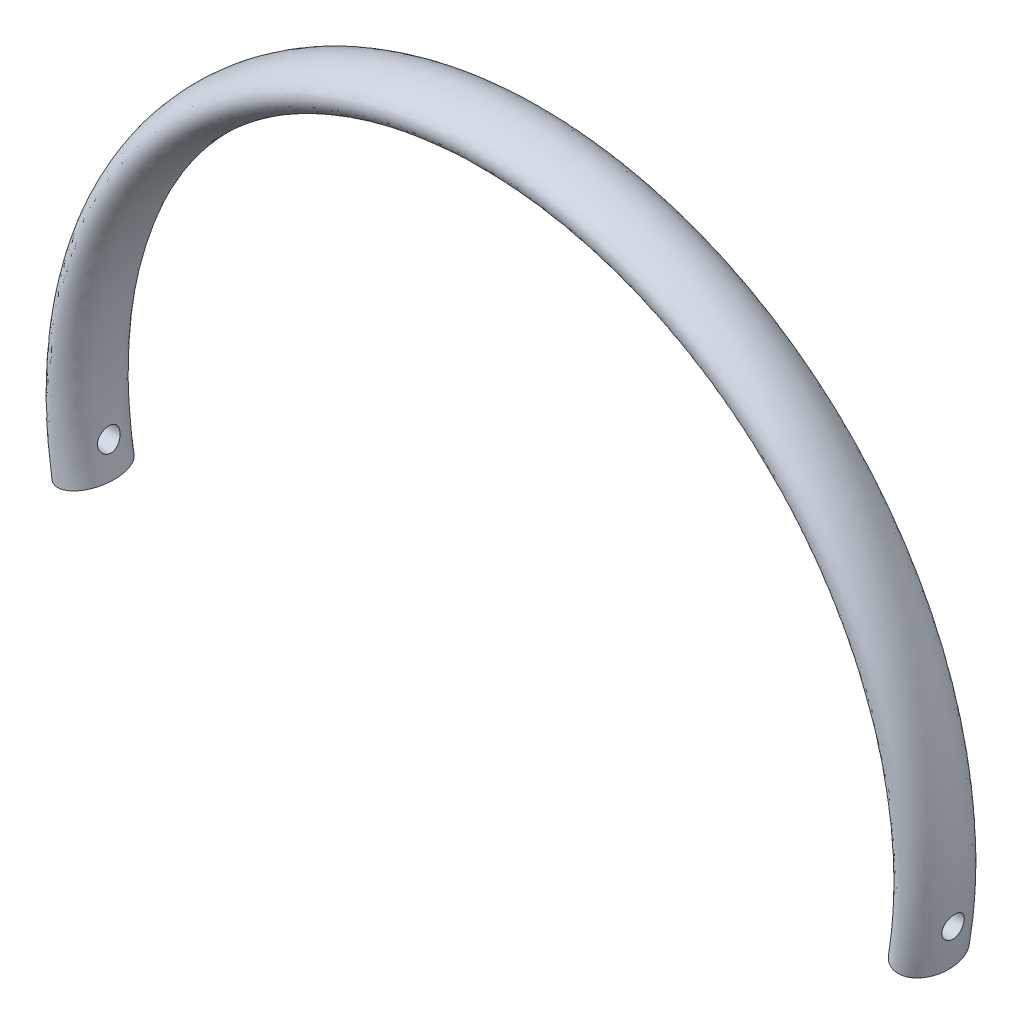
ISO-10303-21;
HEADER;
FILE_DESCRIPTION(('STEP AP214'),'2;1');
FILE_NAME('part.step','',(''),(''),'','','');
FILE_SCHEMA(('AUTOMOTIVE_DESIGN { 1 0 10303 214 1 1 1 1 }'));
ENDSEC;
DATA;
#1=APPLICATION_CONTEXT('core data for automotive mechanical design processes');
#2=APPLICATION_PROTOCOL_DEFINITION('international standard','automotive_design',2000,#1);
#3=PRODUCT_CONTEXT('',#1,'mechanical');
#4=PRODUCT('Part','Part','',(#3));
#5=PRODUCT_RELATED_PRODUCT_CATEGORY('part','',(#4));
#6=PRODUCT_DEFINITION_FORMATION('','',#4);
#7=PRODUCT_DEFINITION_CONTEXT('part definition',#1,'design');
#8=PRODUCT_DEFINITION('design','',#6,#7);
#9=PRODUCT_DEFINITION_SHAPE('','',#8);
#10=(LENGTH_UNIT() NAMED_UNIT(*) SI_UNIT(.MILLI.,.METRE.));
#11=(NAMED_UNIT(*) PLANE_ANGLE_UNIT() SI_UNIT($,.RADIAN.));
#12=(NAMED_UNIT(*) SI_UNIT($,.STERADIAN.) SOLID_ANGLE_UNIT());
#13=UNCERTAINTY_MEASURE_WITH_UNIT(LENGTH_MEASURE(1.E-05),#10,'distance_accuracy_value','');
#14=(GEOMETRIC_REPRESENTATION_CONTEXT(3) GLOBAL_UNCERTAINTY_ASSIGNED_CONTEXT((#13)) GLOBAL_UNIT_ASSIGNED_CONTEXT((#10,
#11,#12)) REPRESENTATION_CONTEXT('',''));
#15=CARTESIAN_POINT('',(0.,0.,0.));
#16=DIRECTION('',(0.,0.,1.));
#17=DIRECTION('',(1.,0.,0.));
#18=AXIS2_PLACEMENT_3D('',#15,#16,#17);
#19=CARTESIAN_POINT('',(751.342132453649,-1.0547118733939E-11,0.));
#20=DIRECTION('',(-0.328671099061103,-0.94444444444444,0.));
#21=DIRECTION('',(0.,0.,-1.));
#22=AXIS2_PLACEMENT_3D('',#19,#20,#21);
#23=ELLIPSE('',#22,63.5,38.1);
#24=CARTESIAN_POINT('',(0.,127.,0.));
#25=DIRECTION('',(0.,0.,1.));
#26=AXIS1_PLACEMENT('',#24,#25);
#27=SURFACE_OF_REVOLUTION('',#23,#26);
#28=CARTESIAN_POINT('',(-794.690720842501,58.441152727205,-20.1788155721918));
#29=CARTESIAN_POINT('',(-794.739829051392,59.0104256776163,-20.1788227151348));
#30=CARTESIAN_POINT('',(-794.793097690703,59.5792348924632,-20.1547170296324));
#31=CARTESIAN_POINT('',(-794.907450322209,60.7121908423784,-20.0586674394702));
#32=CARTESIAN_POINT('',(-794.968536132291,61.2763364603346,-19.9867123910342));
#33=CARTESIAN_POINT('',(-795.097805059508,62.39630857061,-19.7955660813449));
#34=CARTESIAN_POINT('',(-795.16599521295,62.9521261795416,-19.6763276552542));
#35=CARTESIAN_POINT('',(-795.308424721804,64.0509747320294,-19.3916629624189));
#36=CARTESIAN_POINT('',(-795.382663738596,64.5940063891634,-19.2262392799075));
#37=CARTESIAN_POINT('',(-795.535921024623,65.6629657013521,-18.8507443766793));
#38=CARTESIAN_POINT('',(-795.614933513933,66.1889129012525,-18.6407264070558));
#39=CARTESIAN_POINT('',(-795.776489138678,67.220864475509,-18.177490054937));
#40=CARTESIAN_POINT('',(-795.85903231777,67.7268686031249,-17.9242711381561));
#41=CARTESIAN_POINT('',(-796.026191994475,68.715502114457,-17.3764687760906));
#42=CARTESIAN_POINT('',(-796.110808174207,69.1981350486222,-17.0818916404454));
#43=CARTESIAN_POINT('',(-796.280604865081,70.1369260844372,-16.4533458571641));
#44=CARTESIAN_POINT('',(-796.365785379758,70.5930840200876,-16.1193769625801));
#45=CARTESIAN_POINT('',(-796.53624209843,71.4816090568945,-15.4096897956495));
#46=CARTESIAN_POINT('',(-796.62150528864,71.9135921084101,-15.0334873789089));
#47=CARTESIAN_POINT('',(-796.78936836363,72.7442942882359,-14.2454384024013));
#48=CARTESIAN_POINT('',(-796.871968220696,73.1430130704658,-13.8335914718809));
#49=CARTESIAN_POINT('',(-797.03289282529,73.9043629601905,-12.9769830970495));
#50=CARTESIAN_POINT('',(-797.111217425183,74.2669928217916,-12.532220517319));
#51=CARTESIAN_POINT('',(-797.262030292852,74.9534811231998,-11.6127841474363));
#52=CARTESIAN_POINT('',(-797.334518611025,75.2773398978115,-11.1381106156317));
#53=CARTESIAN_POINT('',(-797.471920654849,75.8826189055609,-10.1640225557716));
#54=CARTESIAN_POINT('',(-797.536863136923,76.164201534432,-9.66471302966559));
#55=CARTESIAN_POINT('',(-797.658175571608,76.6842297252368,-8.6431045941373));
#56=CARTESIAN_POINT('',(-797.714545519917,76.92267526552,-8.12080567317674));
#57=CARTESIAN_POINT('',(-797.817533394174,77.3544411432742,-7.05702372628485));
#58=CARTESIAN_POINT('',(-797.864152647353,77.5477676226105,-6.51554332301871));
#59=CARTESIAN_POINT('',(-797.946663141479,77.8876877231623,-5.41731153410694));
#60=CARTESIAN_POINT('',(-797.982554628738,78.0342824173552,-4.86056049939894));
#61=CARTESIAN_POINT('',(-798.042073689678,78.2763293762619,-3.75032014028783));
#62=CARTESIAN_POINT('',(-798.065990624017,78.3729903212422,-3.19710959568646));
#63=CARTESIAN_POINT('',(-798.102417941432,78.5198922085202,-2.08418888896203));
#64=CARTESIAN_POINT('',(-798.114928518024,78.5701339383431,-1.52447883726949));
#65=CARTESIAN_POINT('',(-798.128283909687,78.6237605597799,-0.402742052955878));
#66=CARTESIAN_POINT('',(-798.129130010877,78.6271506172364,0.159284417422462));
#67=CARTESIAN_POINT('',(-798.119142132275,78.5870574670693,1.28155625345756));
#68=CARTESIAN_POINT('',(-798.108308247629,78.5435746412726,1.8418016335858));
#69=CARTESIAN_POINT('',(-798.07548877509,78.4113376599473,2.94617048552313));
#70=CARTESIAN_POINT('',(-798.053710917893,78.3234266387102,3.49040135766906));
#71=CARTESIAN_POINT('',(-797.999548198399,78.1035250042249,4.56933495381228));
#72=CARTESIAN_POINT('',(-797.967163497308,77.9715350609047,5.10403782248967));
#73=CARTESIAN_POINT('',(-797.892422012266,77.6645377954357,6.16023773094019));
#74=CARTESIAN_POINT('',(-797.850065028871,77.4895296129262,6.68173450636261));
#75=CARTESIAN_POINT('',(-797.756200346,77.0978691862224,7.70799542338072));
#76=CARTESIAN_POINT('',(-797.704692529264,76.8812164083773,8.21275935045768));
#77=CARTESIAN_POINT('',(-797.593005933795,76.4057631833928,9.206715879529));
#78=CARTESIAN_POINT('',(-797.532752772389,76.1465984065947,9.69572580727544));
#79=CARTESIAN_POINT('',(-797.405084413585,75.5894679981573,10.6501273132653));
#80=CARTESIAN_POINT('',(-797.337669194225,75.2915022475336,11.1155188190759));
#81=CARTESIAN_POINT('',(-797.196936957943,74.6588635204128,12.0197741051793));
#82=CARTESIAN_POINT('',(-797.123619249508,74.3241862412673,12.4586347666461));
#83=CARTESIAN_POINT('',(-796.972444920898,73.6204559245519,13.3070328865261));
#84=CARTESIAN_POINT('',(-796.894588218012,73.2514022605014,13.7165698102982));
#85=CARTESIAN_POINT('',(-796.733658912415,72.4712251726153,14.5141657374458));
#86=CARTESIAN_POINT('',(-796.650502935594,72.0592495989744,14.9013747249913));
#87=CARTESIAN_POINT('',(-796.482468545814,71.2044794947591,15.639726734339));
#88=CARTESIAN_POINT('',(-796.39759010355,70.7616844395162,15.9908691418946));
#89=CARTESIAN_POINT('',(-796.227674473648,69.8481888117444,16.6548184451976));
#90=CARTESIAN_POINT('',(-796.142637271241,69.3774855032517,16.9676215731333));
#91=CARTESIAN_POINT('',(-795.973956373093,68.4113224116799,17.5527571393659));
#92=CARTESIAN_POINT('',(-795.890312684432,67.9158625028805,17.8250893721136));
#93=CARTESIAN_POINT('',(-795.72464708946,66.8957327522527,18.3312244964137));
#94=CARTESIAN_POINT('',(-795.642669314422,66.3707328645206,18.5643770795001));
#95=CARTESIAN_POINT('',(-795.483124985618,65.3021764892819,18.9852757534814));
#96=CARTESIAN_POINT('',(-795.405558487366,64.7586197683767,19.1730212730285));
#97=CARTESIAN_POINT('',(-795.256146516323,63.6567689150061,19.5016006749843));
#98=CARTESIAN_POINT('',(-795.18430070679,63.0984756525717,19.6424373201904));
#99=CARTESIAN_POINT('',(-795.047448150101,61.971091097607,19.8760032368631));
#100=CARTESIAN_POINT('',(-794.982441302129,61.4019999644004,19.9687332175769));
#101=CARTESIAN_POINT('',(-794.860842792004,60.2634589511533,20.1044482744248));
#102=CARTESIAN_POINT('',(-794.804166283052,59.6940821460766,20.1479703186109));
#103=CARTESIAN_POINT('',(-794.699017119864,58.5529289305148,20.1865802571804));
#104=CARTESIAN_POINT('',(-794.650544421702,57.9811525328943,20.1816684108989));
#105=CARTESIAN_POINT('',(-794.562180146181,56.8394715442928,20.1232675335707));
#106=CARTESIAN_POINT('',(-794.522287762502,56.269566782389,20.0697830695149));
#107=CARTESIAN_POINT('',(-794.451182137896,55.1358342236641,19.9144877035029));
#108=CARTESIAN_POINT('',(-794.419968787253,54.5720063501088,19.8126774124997));
#109=CARTESIAN_POINT('',(-794.366559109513,53.4650714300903,19.5637171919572));
#110=CARTESIAN_POINT('',(-794.344205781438,52.9217740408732,19.4174463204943));
#111=CARTESIAN_POINT('',(-794.307309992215,51.8490552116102,19.0799631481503));
#112=CARTESIAN_POINT('',(-794.292767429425,51.3196335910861,18.8887514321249));
#113=CARTESIAN_POINT('',(-794.270895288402,50.2784914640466,18.4627173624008));
#114=CARTESIAN_POINT('',(-794.263565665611,49.7667708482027,18.2278952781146));
#115=CARTESIAN_POINT('',(-794.255345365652,48.7646955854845,17.716298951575));
#116=CARTESIAN_POINT('',(-794.254454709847,48.2743410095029,17.439524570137));
#117=CARTESIAN_POINT('',(-794.258195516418,47.3197143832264,16.8467526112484));
#118=CARTESIAN_POINT('',(-794.262812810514,46.8553786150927,16.5308575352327));
#119=CARTESIAN_POINT('',(-794.276543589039,45.9546888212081,15.8615142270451));
#120=CARTESIAN_POINT('',(-794.28565705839,45.5183347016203,15.5080661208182));
#121=CARTESIAN_POINT('',(-794.307320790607,44.6766239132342,14.7660797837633));
#122=CARTESIAN_POINT('',(-794.319871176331,44.2712683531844,14.3775402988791));
#123=CARTESIAN_POINT('',(-794.347329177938,43.494370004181,13.5680870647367));
#124=CARTESIAN_POINT('',(-794.36223681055,43.1228274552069,13.1471730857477));
#125=CARTESIAN_POINT('',(-794.393475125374,42.4131641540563,12.2722490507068));
#126=CARTESIAN_POINT('',(-794.409816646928,42.0753482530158,11.8179920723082));
#127=CARTESIAN_POINT('',(-794.442771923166,41.4390651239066,10.8827165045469));
#128=CARTESIAN_POINT('',(-794.459385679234,41.1405980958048,10.4016977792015));
#129=CARTESIAN_POINT('',(-794.491920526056,40.5851058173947,9.41626779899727));
#130=CARTESIAN_POINT('',(-794.507841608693,40.328081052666,8.91185627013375));
#131=CARTESIAN_POINT('',(-794.53812839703,39.8572916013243,7.88318807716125));
#132=CARTESIAN_POINT('',(-794.552494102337,39.6435269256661,7.35893140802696));
#133=CARTESIAN_POINT('',(-794.578974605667,39.2601511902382,6.29252494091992));
#134=CARTESIAN_POINT('',(-794.591081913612,39.0906863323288,5.7503223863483));
#135=CARTESIAN_POINT('',(-794.612384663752,38.7980464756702,4.65350786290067));
#136=CARTESIAN_POINT('',(-794.621580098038,38.6748716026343,4.09889586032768));
#137=CARTESIAN_POINT('',(-794.636613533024,38.4757051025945,2.98122576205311));
#138=CARTESIAN_POINT('',(-794.642451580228,38.3997128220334,2.41816778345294));
#139=CARTESIAN_POINT('',(-794.650492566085,38.2954617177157,1.28762503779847));
#140=CARTESIAN_POINT('',(-794.652695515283,38.2672027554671,0.720140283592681));
#141=CARTESIAN_POINT('',(-794.653361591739,38.2586352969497,-0.413655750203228));
#142=CARTESIAN_POINT('',(-794.651834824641,38.278197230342,-0.979966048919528));
#143=CARTESIAN_POINT('',(-794.645134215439,38.3648586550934,-2.10891493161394));
#144=CARTESIAN_POINT('',(-794.639960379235,38.4319580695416,-2.67155352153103));
#145=CARTESIAN_POINT('',(-794.626209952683,38.613208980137,-3.78915815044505));
#146=CARTESIAN_POINT('',(-794.61763335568,38.7273605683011,-4.34412417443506));
#147=CARTESIAN_POINT('',(-794.597488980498,39.0018933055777,-5.44244537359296));
#148=CARTESIAN_POINT('',(-794.585921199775,39.1622744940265,-5.98580053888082));
#149=CARTESIAN_POINT('',(-794.560367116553,39.5280709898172,-7.0569210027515));
#150=CARTESIAN_POINT('',(-794.546381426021,39.7334749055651,-7.58469020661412));
#151=CARTESIAN_POINT('',(-794.516703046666,40.1878790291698,-8.62106353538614));
#152=CARTESIAN_POINT('',(-794.501010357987,40.4368792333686,-9.12966766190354));
#153=CARTESIAN_POINT('',(-794.468759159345,40.9767158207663,-10.1241364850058));
#154=CARTESIAN_POINT('',(-794.452200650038,41.2675521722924,-10.6100011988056));
#155=CARTESIAN_POINT('',(-794.419166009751,41.8890165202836,-11.5555818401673));
#156=CARTESIAN_POINT('',(-794.4026898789,42.2196445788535,-12.015297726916));
#157=CARTESIAN_POINT('',(-794.370806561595,42.9193483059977,-12.9065902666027));
#158=CARTESIAN_POINT('',(-794.355402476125,43.2885283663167,-13.3380850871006));
#159=CARTESIAN_POINT('',(-794.326808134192,44.0619739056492,-14.1684776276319));
#160=CARTESIAN_POINT('',(-794.313617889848,44.4662395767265,-14.5673751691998));
#161=CARTESIAN_POINT('',(-794.290565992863,45.3070790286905,-15.3298023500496));
#162=CARTESIAN_POINT('',(-794.280704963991,45.7436588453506,-15.6933253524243));
#163=CARTESIAN_POINT('',(-794.26541835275,46.645950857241,-16.3823078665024));
#164=CARTESIAN_POINT('',(-794.259992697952,47.1116625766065,-16.7077679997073));
#165=CARTESIAN_POINT('',(-794.254631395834,48.0679495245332,-17.3176856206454));
#166=CARTESIAN_POINT('',(-794.254684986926,48.5584741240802,-17.6022223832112));
#167=CARTESIAN_POINT('',(-794.261203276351,49.5617159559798,-18.1290163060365));
#168=CARTESIAN_POINT('',(-794.267668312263,50.0744343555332,-18.3712712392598));
#169=CARTESIAN_POINT('',(-794.287814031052,51.1178340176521,-18.8115356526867));
#170=CARTESIAN_POINT('',(-794.301487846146,51.6484977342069,-19.0095869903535));
#171=CARTESIAN_POINT('',(-794.336669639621,52.7241817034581,-19.3602924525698));
#172=CARTESIAN_POINT('',(-794.358175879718,53.2691987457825,-19.5129566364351));
#173=CARTESIAN_POINT('',(-794.419115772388,54.5768758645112,-19.8206153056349));
#174=CARTESIAN_POINT('',(-794.46224956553,55.3443283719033,-19.9549093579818));
#175=CARTESIAN_POINT('',(-794.564586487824,56.8885253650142,-20.1340042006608));
#176=CARTESIAN_POINT('',(-794.623789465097,57.6652697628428,-20.1788058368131));
#177=CARTESIAN_POINT('',(-794.690720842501,58.441152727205,-20.1788155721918));
#178=B_SPLINE_CURVE_WITH_KNOTS('',3,(#28,#29,#30,#31,#32,#33,#34,#35,#36,#37,#38,#39,#40,#41,
#42,#43,#44,#45,#46,#47,#48,#49,#50,#51,#52,#53,#54,#55,#56,#57,#58,#59,#60,#61,#62,#63,#64,#65,
#66,#67,#68,#69,#70,#71,#72,#73,#74,#75,#76,#77,#78,#79,#80,#81,#82,#83,#84,#85,#86,#87,#88,#89,
#90,#91,#92,#93,#94,#95,#96,#97,#98,#99,#100,#101,#102,#103,#104,#105,#106,#107,#108,#109,#110,
#111,#112,#113,#114,#115,#116,#117,#118,#119,#120,#121,#122,#123,#124,#125,#126,#127,#128,#129,
#130,#131,#132,#133,#134,#135,#136,#137,#138,#139,#140,#141,#142,#143,#144,#145,#146,#147,#148,
#149,#150,#151,#152,#153,#154,#155,#156,#157,#158,#159,#160,#161,#162,#163,#164,#165,#166,#167,
#168,#169,#170,#171,#172,#173,#174,#175,#176,#177),.UNSPECIFIED.,.T.,.F.,(4,2,2,2,2,2,2,2,2,2,2,
2,2,2,2,2,2,2,2,2,2,2,2,2,2,2,2,2,2,2,2,2,2,2,2,2,2,2,2,2,2,2,2,2,2,2,2,2,2,2,2,2,2,2,2,2,2,2,2,
2,2,2,2,2,2,2,2,2,2,2,2,2,2,2,4),(0.,1.71346327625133,3.42732574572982,5.14290209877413,
6.85838247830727,8.57182576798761,10.2852902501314,11.9984936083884,13.7117077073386,
15.4470819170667,17.1824741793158,18.9179263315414,20.653363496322,22.3819536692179,
24.1105447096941,25.8389003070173,27.5672162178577,29.2514651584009,30.9356855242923,
32.6197201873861,34.3037411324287,35.9569406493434,37.61011504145,39.2633224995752,
40.9165511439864,42.5847690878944,44.2529921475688,45.9214109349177,47.5898601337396,
49.3022621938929,51.014693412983,52.7272927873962,54.4399008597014,56.1786043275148,
57.917329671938,59.6559525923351,61.3945498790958,63.1139863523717,64.833413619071,
66.5526792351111,68.2719231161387,69.959170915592,71.646396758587,73.3336121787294,
75.0208331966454,76.7037234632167,78.3866080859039,80.0695528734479,81.7525096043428,
83.4495136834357,85.1465263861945,86.8435589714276,88.5405919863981,90.2431569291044,
91.9457264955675,93.6482724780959,95.3508135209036,97.048746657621,98.7466770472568,
100.444610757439,102.142545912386,103.840051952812,105.537557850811,107.235062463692,
108.932569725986,110.634798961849,112.337037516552,114.039594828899,115.742124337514,
117.441310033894,119.140585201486,120.838244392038,122.53552704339,124.870891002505,
127.20623288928),.UNSPECIFIED.);
#179=CARTESIAN_POINT('',(-794.690720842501,58.441152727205,-20.1788155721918));
#180=VERTEX_POINT('',#179);
#181=EDGE_CURVE('E36',#180,#180,#178,.T.);
#182=ORIENTED_EDGE('',*,*,#181,.T.);
#183=EDGE_LOOP('',(#182));
#184=FACE_BOUND('',#183,.T.);
#185=CARTESIAN_POINT('',(-723.162550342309,58.441152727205,-20.1788155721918));
#186=CARTESIAN_POINT('',(-723.108646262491,57.8725903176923,-20.1788121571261));
#187=CARTESIAN_POINT('',(-723.049315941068,57.3044630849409,-20.1547643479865));
#188=CARTESIAN_POINT('',(-722.920420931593,56.1733476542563,-20.059011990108));
#189=CARTESIAN_POINT('',(-722.850854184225,55.6103605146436,-19.9872978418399));
#190=CARTESIAN_POINT('',(-722.702361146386,54.4931125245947,-19.7969430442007));
#191=CARTESIAN_POINT('',(-722.623426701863,53.9388597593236,-19.6782612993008));
#192=CARTESIAN_POINT('',(-722.457466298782,52.8434580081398,-19.3951137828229));
#193=CARTESIAN_POINT('',(-722.370440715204,52.3023084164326,-19.2306501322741));
#194=CARTESIAN_POINT('',(-722.189890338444,51.2375608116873,-18.857639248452));
#195=CARTESIAN_POINT('',(-722.096376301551,50.7139357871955,-18.6491638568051));
#196=CARTESIAN_POINT('',(-721.904352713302,49.686698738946,-18.1895781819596));
#197=CARTESIAN_POINT('',(-721.805843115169,49.1830869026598,-17.9384674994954));
#198=CARTESIAN_POINT('',(-721.605608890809,48.199103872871,-17.3954244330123));
#199=CARTESIAN_POINT('',(-721.503884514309,47.718730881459,-17.1034952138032));
#200=CARTESIAN_POINT('',(-721.299085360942,46.7841909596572,-16.4807508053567));
#201=CARTESIAN_POINT('',(-721.196010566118,46.3300243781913,-16.1499350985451));
#202=CARTESIAN_POINT('',(-720.988233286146,45.441298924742,-15.4440059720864));
#203=CARTESIAN_POINT('',(-720.883543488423,45.0073720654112,-15.0680926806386));
#204=CARTESIAN_POINT('',(-720.676866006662,44.1727727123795,-14.2803090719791));
#205=CARTESIAN_POINT('',(-720.574878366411,43.7721007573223,-13.8684381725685));
#206=CARTESIAN_POINT('',(-720.375684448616,43.0067929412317,-13.0113496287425));
#207=CARTESIAN_POINT('',(-720.278478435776,42.642159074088,-12.5661301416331));
#208=CARTESIAN_POINT('',(-720.090891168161,41.9516351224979,-11.6452397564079));
#209=CARTESIAN_POINT('',(-720.000509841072,41.625744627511,-11.1695691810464));
#210=CARTESIAN_POINT('',(-719.828734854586,41.0160154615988,-10.1921593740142));
#211=CARTESIAN_POINT('',(-719.747319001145,40.7320723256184,-9.69048925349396));
#212=CARTESIAN_POINT('',(-719.595007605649,40.2075959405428,-8.66339925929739));
#213=CARTESIAN_POINT('',(-719.524112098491,39.9670628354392,-8.13797930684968));
#214=CARTESIAN_POINT('',(-719.394466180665,39.5315680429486,-7.06725883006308));
#215=CARTESIAN_POINT('',(-719.335713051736,39.3365961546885,-6.52196278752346));
#216=CARTESIAN_POINT('',(-719.23170438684,38.9939703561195,-5.41544966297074));
#217=CARTESIAN_POINT('',(-719.186448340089,38.8463146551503,-4.85423318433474));
#218=CARTESIAN_POINT('',(-719.111977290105,38.6045102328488,-3.74211670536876));
#219=CARTESIAN_POINT('',(-719.082210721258,38.5085167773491,-3.19165418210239));
#220=CARTESIAN_POINT('',(-719.036816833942,38.362479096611,-2.08409194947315));
#221=CARTESIAN_POINT('',(-719.02118915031,38.3124336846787,-1.52699241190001));
#222=CARTESIAN_POINT('',(-719.004429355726,38.2587721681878,-0.41043900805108));
#223=CARTESIAN_POINT('',(-719.003294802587,38.2551482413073,0.149014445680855));
#224=CARTESIAN_POINT('',(-719.01554107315,38.2943447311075,1.26612826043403));
#225=CARTESIAN_POINT('',(-719.0289217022,38.3371645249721,1.82378864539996));
#226=CARTESIAN_POINT('',(-719.069296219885,38.4669202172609,2.9169790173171));
#227=CARTESIAN_POINT('',(-719.095883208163,38.5525379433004,3.45268117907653));
#228=CARTESIAN_POINT('',(-719.16188589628,38.7664072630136,4.51468460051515));
#229=CARTESIAN_POINT('',(-719.201301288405,38.8946578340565,5.04098608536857));
#230=CARTESIAN_POINT('',(-719.292139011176,39.1927011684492,6.08063795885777));
#231=CARTESIAN_POINT('',(-719.343561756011,39.3624953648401,6.593987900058));
#232=CARTESIAN_POINT('',(-719.4573618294,39.7422333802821,7.60436022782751));
#233=CARTESIAN_POINT('',(-719.519739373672,39.9521779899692,8.10138229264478));
#234=CARTESIAN_POINT('',(-719.655157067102,40.4138298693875,9.08286804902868));
#235=CARTESIAN_POINT('',(-719.728335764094,40.6660866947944,9.56705404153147));
#236=CARTESIAN_POINT('',(-719.883217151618,41.2083010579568,10.5123904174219));
#237=CARTESIAN_POINT('',(-719.964919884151,41.49825878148,10.9735406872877));
#238=CARTESIAN_POINT('',(-720.135276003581,42.1138591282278,11.8701239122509));
#239=CARTESIAN_POINT('',(-720.223930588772,42.4395079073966,12.3055524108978));
#240=CARTESIAN_POINT('',(-720.40650078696,43.1242578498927,13.1480811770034));
#241=CARTESIAN_POINT('',(-720.500416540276,43.4833599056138,13.5551806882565));
#242=CARTESIAN_POINT('',(-720.695675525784,44.2479964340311,14.3546929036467));
#243=CARTESIAN_POINT('',(-720.79716547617,44.6548266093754,14.7458314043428));
#244=CARTESIAN_POINT('',(-721.001981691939,45.4995387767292,15.4924822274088));
#245=CARTESIAN_POINT('',(-721.105308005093,45.937421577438,15.8479936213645));
#246=CARTESIAN_POINT('',(-721.311832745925,46.841489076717,16.5212008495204));
#247=CARTESIAN_POINT('',(-721.415031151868,47.3076780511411,16.8388909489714));
#248=CARTESIAN_POINT('',(-721.619345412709,48.2653456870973,17.4343187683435));
#249=CARTESIAN_POINT('',(-721.720461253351,48.7568245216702,17.7120562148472));
#250=CARTESIAN_POINT('',(-721.920954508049,49.7731423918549,18.2313745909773));
#251=CARTESIAN_POINT('',(-722.020243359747,50.2984800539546,18.4720149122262));
#252=CARTESIAN_POINT('',(-722.212841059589,51.3688175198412,18.9076844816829));
#253=CARTESIAN_POINT('',(-722.30614979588,51.9138176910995,19.1027128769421));
#254=CARTESIAN_POINT('',(-722.485094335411,53.0196611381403,19.4454898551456));
#255=CARTESIAN_POINT('',(-722.570730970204,53.5805026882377,19.5932435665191));
#256=CARTESIAN_POINT('',(-722.732888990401,54.7140840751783,19.8401113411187));
#257=CARTESIAN_POINT('',(-722.809410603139,55.2868236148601,19.9392266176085));
#258=CARTESIAN_POINT('',(-722.950813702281,56.4290266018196,20.0863433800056));
#259=CARTESIAN_POINT('',(-723.015888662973,56.9983456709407,20.135279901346));
#260=CARTESIAN_POINT('',(-723.135343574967,58.1402067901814,20.1846620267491));
#261=CARTESIAN_POINT('',(-723.189723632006,58.7127488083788,20.1851081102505));
#262=CARTESIAN_POINT('',(-723.287316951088,59.8566629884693,20.1372438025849));
#263=CARTESIAN_POINT('',(-723.330531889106,60.4280353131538,20.0889407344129));
#264=CARTESIAN_POINT('',(-723.405693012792,61.5653175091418,19.9437407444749));
#265=CARTESIAN_POINT('',(-723.437639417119,62.1312274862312,19.8468447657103));
#266=CARTESIAN_POINT('',(-723.489742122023,63.2370133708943,19.6085422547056));
#267=CARTESIAN_POINT('',(-723.510212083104,63.77716927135,19.4685010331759));
#268=CARTESIAN_POINT('',(-723.541275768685,64.8442766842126,19.1440742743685));
#269=CARTESIAN_POINT('',(-723.551869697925,65.3712284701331,18.9596896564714));
#270=CARTESIAN_POINT('',(-723.563970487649,66.4081295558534,18.5478591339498));
#271=CARTESIAN_POINT('',(-723.56547733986,66.9180788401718,18.3204131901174));
#272=CARTESIAN_POINT('',(-723.560419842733,67.9173475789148,17.8240724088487));
#273=CARTESIAN_POINT('',(-723.553855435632,68.4066668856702,17.5551772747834));
#274=CARTESIAN_POINT('',(-723.533867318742,69.3604323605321,16.978339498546));
#275=CARTESIAN_POINT('',(-723.520455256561,69.824919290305,16.6704638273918));
#276=CARTESIAN_POINT('',(-723.488095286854,70.7267188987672,16.0174709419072));
#277=CARTESIAN_POINT('',(-723.469147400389,71.1640316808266,15.6723538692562));
#278=CARTESIAN_POINT('',(-723.427109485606,72.0085505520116,14.9472434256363));
#279=CARTESIAN_POINT('',(-723.404019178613,72.4157546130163,14.5672477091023));
#280=CARTESIAN_POINT('',(-723.355123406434,73.1972934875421,13.7749967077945));
#281=CARTESIAN_POINT('',(-723.329317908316,73.5716279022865,13.3627410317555));
#282=CARTESIAN_POINT('',(-723.275999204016,74.2903966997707,12.5022056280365));
#283=CARTESIAN_POINT('',(-723.248465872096,74.6342842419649,12.0534702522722));
#284=CARTESIAN_POINT('',(-723.193481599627,75.2832135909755,11.1287310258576));
#285=CARTESIAN_POINT('',(-723.16603065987,75.5882550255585,10.6527269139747));
#286=CARTESIAN_POINT('',(-723.112540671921,76.1573725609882,9.67673843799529));
#287=CARTESIAN_POINT('',(-723.086501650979,76.4214478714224,9.17675361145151));
#288=CARTESIAN_POINT('',(-723.037037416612,76.9067648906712,8.15628513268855));
#289=CARTESIAN_POINT('',(-723.013612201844,77.1280066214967,7.63580149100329));
#290=CARTESIAN_POINT('',(-722.970312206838,77.5270484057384,6.57538385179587));
#291=CARTESIAN_POINT('',(-722.950455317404,77.7046311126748,6.0353673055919));
#292=CARTESIAN_POINT('',(-722.915301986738,78.0136469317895,4.94213808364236));
#293=CARTESIAN_POINT('',(-722.900005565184,78.1450798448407,4.38892535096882));
#294=CARTESIAN_POINT('',(-722.874630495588,78.3608157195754,3.27328701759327));
#295=CARTESIAN_POINT('',(-722.864551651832,78.4451204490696,2.71086176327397));
#296=CARTESIAN_POINT('',(-722.850038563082,78.5659745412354,1.580832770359));
#297=CARTESIAN_POINT('',(-722.845604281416,78.6025242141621,1.01322906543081));
#298=CARTESIAN_POINT('',(-722.842576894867,78.627511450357,-0.119320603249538));
#299=CARTESIAN_POINT('',(-722.843945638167,78.6162632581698,-0.684259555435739));
#300=CARTESIAN_POINT('',(-722.852380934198,78.5464501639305,-1.81116135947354));
#301=CARTESIAN_POINT('',(-722.859447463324,78.4878854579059,-2.37312422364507));
#302=CARTESIAN_POINT('',(-722.878983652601,78.3238749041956,-3.49006794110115));
#303=CARTESIAN_POINT('',(-722.891453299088,78.2184291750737,-4.04504881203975));
#304=CARTESIAN_POINT('',(-722.921271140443,77.9614335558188,-5.1440960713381));
#305=CARTESIAN_POINT('',(-722.938619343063,77.8098835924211,-5.68816244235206));
#306=CARTESIAN_POINT('',(-722.977432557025,77.4619715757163,-6.76096864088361));
#307=CARTESIAN_POINT('',(-722.998893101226,77.2656581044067,-7.2897243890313));
#308=CARTESIAN_POINT('',(-723.045008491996,76.8295348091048,-8.32883503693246));
#309=CARTESIAN_POINT('',(-723.069663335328,76.5897250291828,-8.83918995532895));
#310=CARTESIAN_POINT('',(-723.121061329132,76.068293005,-9.83798276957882));
#311=CARTESIAN_POINT('',(-723.147804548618,75.786669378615,-10.3264199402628));
#312=CARTESIAN_POINT('',(-723.202127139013,75.1835764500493,-11.2779942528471));
#313=CARTESIAN_POINT('',(-723.229706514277,74.8621069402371,-11.7411312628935));
#314=CARTESIAN_POINT('',(-723.284521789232,74.1792378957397,-12.6419487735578));
#315=CARTESIAN_POINT('',(-723.311754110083,73.8175832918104,-13.0794361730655));
#316=CARTESIAN_POINT('',(-723.364212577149,73.0586462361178,-13.9224695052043));
#317=CARTESIAN_POINT('',(-723.389438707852,72.6613635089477,-14.3280151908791));
#318=CARTESIAN_POINT('',(-723.43637923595,71.833869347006,-15.1043586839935));
#319=CARTESIAN_POINT('',(-723.458093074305,71.4036526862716,-15.475150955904));
#320=CARTESIAN_POINT('',(-723.496501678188,70.5133657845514,-16.1792568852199));
#321=CARTESIAN_POINT('',(-723.51319651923,70.053295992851,-16.5125711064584));
#322=CARTESIAN_POINT('',(-723.540105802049,69.1071787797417,-17.1389008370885));
#323=CARTESIAN_POINT('',(-723.550328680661,68.6211660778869,-17.4319684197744));
#324=CARTESIAN_POINT('',(-723.563000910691,67.6260782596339,-17.9761878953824));
#325=CARTESIAN_POINT('',(-723.565449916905,67.1170021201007,-18.2273379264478));
#326=CARTESIAN_POINT('',(-723.561414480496,66.0799787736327,-18.6856646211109));
#327=CARTESIAN_POINT('',(-723.55493755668,65.5520478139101,-18.8928781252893));
#328=CARTESIAN_POINT('',(-723.532121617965,64.4808704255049,-19.2620661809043));
#329=CARTESIAN_POINT('',(-723.515784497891,63.937626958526,-19.424049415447));
#330=CARTESIAN_POINT('',(-723.478272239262,62.9843320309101,-19.6651542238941));
#331=CARTESIAN_POINT('',(-723.459499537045,62.5768268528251,-19.754864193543));
#332=CARTESIAN_POINT('',(-723.416075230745,61.7572556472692,-19.9088397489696));
#333=CARTESIAN_POINT('',(-723.391422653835,61.3451888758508,-19.9731011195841));
#334=CARTESIAN_POINT('',(-723.336170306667,60.5182678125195,-20.0759503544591));
#335=CARTESIAN_POINT('',(-723.305570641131,60.1034135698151,-20.1145386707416));
#336=CARTESIAN_POINT('',(-723.238463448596,59.2726794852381,-20.165970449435));
#337=CARTESIAN_POINT('',(-723.201956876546,58.8567998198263,-20.1788180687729));
#338=CARTESIAN_POINT('',(-723.162550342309,58.441152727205,-20.1788155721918));
#339=B_SPLINE_CURVE_WITH_KNOTS('',3,(#185,#186,#187,#188,#189,#190,#191,#192,#193,#194,#195,
#196,#197,#198,#199,#200,#201,#202,#203,#204,#205,#206,#207,#208,#209,#210,#211,#212,#213,#214,
#215,#216,#217,#218,#219,#220,#221,#222,#223,#224,#225,#226,#227,#228,#229,#230,#231,#232,#233,
#234,#235,#236,#237,#238,#239,#240,#241,#242,#243,#244,#245,#246,#247,#248,#249,#250,#251,#252,
#253,#254,#255,#256,#257,#258,#259,#260,#261,#262,#263,#264,#265,#266,#267,#268,#269,#270,#271,
#272,#273,#274,#275,#276,#277,#278,#279,#280,#281,#282,#283,#284,#285,#286,#287,#288,#289,#290,
#291,#292,#293,#294,#295,#296,#297,#298,#299,#300,#301,#302,#303,#304,#305,#306,#307,#308,#309,
#310,#311,#312,#313,#314,#315,#316,#317,#318,#319,#320,#321,#322,#323,#324,#325,#326,#327,#328,
#329,#330,#331,#332,#333,#334,#335,#336,#337,#338),.UNSPECIFIED.,.T.,.F.,(4,2,2,2,2,2,2,2,2,2,2,
2,2,2,2,2,2,2,2,2,2,2,2,2,2,2,2,2,2,2,2,2,2,2,2,2,2,2,2,2,2,2,2,2,2,2,2,2,2,2,2,2,2,2,2,2,2,2,2,
2,2,2,2,2,2,2,2,2,2,2,2,2,2,2,2,2,4),(0.,1.71294879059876,3.42624265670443,5.14103894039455,
6.85575579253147,8.56769501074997,10.2796502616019,11.99147285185,13.7033182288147,
15.4519905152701,17.2006911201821,18.9494884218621,20.6982671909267,22.4426146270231,
24.1869678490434,25.9309301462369,27.6748264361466,29.3514345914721,31.0279994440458,
32.704281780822,34.3805416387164,36.0080894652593,37.6355982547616,39.2631631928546,
40.8907601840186,42.5414171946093,44.1920823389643,45.8430326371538,47.4940269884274,
49.2122890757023,50.9305959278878,52.6491629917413,54.3677418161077,56.1245104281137,
57.8813118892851,59.6379227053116,61.3944897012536,63.1176947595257,64.8408827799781,
66.5638119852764,68.2867077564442,69.9598796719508,71.6330169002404,73.3061556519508,
74.9793063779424,76.6496205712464,78.3199284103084,79.9903486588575,81.6607891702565,
83.3568577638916,85.0529426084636,86.7490601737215,88.4451768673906,90.1495736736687,
91.8539778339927,93.5583180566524,95.2626472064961,96.9557887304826,98.648923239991,
100.342053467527,102.035186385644,103.726490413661,105.417792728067,107.109150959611,
108.800518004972,110.50331073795,112.206116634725,113.909193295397,115.612244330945,
117.313070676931,119.013972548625,120.713442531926,122.412586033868,123.664852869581,
124.917327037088,126.169779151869,127.422028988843),.UNSPECIFIED.);
#340=CARTESIAN_POINT('',(-723.162550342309,58.441152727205,-20.1788155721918));
#341=VERTEX_POINT('',#340);
#342=EDGE_CURVE('E68',#341,#341,#339,.T.);
#343=ORIENTED_EDGE('',*,*,#342,.T.);
#344=EDGE_LOOP('',(#343));
#345=FACE_BOUND('',#344,.T.);
#346=CARTESIAN_POINT('',(723.162550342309,58.441152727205,-20.1788155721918));
#347=CARTESIAN_POINT('',(723.21506284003,58.995070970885,-20.178813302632));
#348=CARTESIAN_POINT('',(723.262436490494,59.549524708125,-20.1559895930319));
#349=CARTESIAN_POINT('',(723.346629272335,60.6554982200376,-20.0646262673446));
#350=CARTESIAN_POINT('',(723.383447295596,61.2070176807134,-19.9960818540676));
#351=CARTESIAN_POINT('',(723.44658789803,62.3033644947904,-19.8135525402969));
#352=CARTESIAN_POINT('',(723.472905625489,62.8481886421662,-19.6995466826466));
#353=CARTESIAN_POINT('',(723.515372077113,63.9269090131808,-19.4268006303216));
#354=CARTESIAN_POINT('',(723.531521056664,64.4608055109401,-19.2680615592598));
#355=CARTESIAN_POINT('',(723.554282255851,65.5135895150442,-18.9070033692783));
#356=CARTESIAN_POINT('',(723.560898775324,66.0324836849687,-18.7047039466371));
#357=CARTESIAN_POINT('',(723.565492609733,67.0518090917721,-18.257898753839));
#358=CARTESIAN_POINT('',(723.563469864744,67.552240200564,-18.0133926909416));
#359=CARTESIAN_POINT('',(723.551874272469,68.5311002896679,-17.4839120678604));
#360=CARTESIAN_POINT('',(723.54230162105,69.0095298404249,-17.1989385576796));
#361=CARTESIAN_POINT('',(723.516852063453,69.941089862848,-16.5905257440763));
#362=CARTESIAN_POINT('',(723.500975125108,70.3942202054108,-16.2670862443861));
#363=CARTESIAN_POINT('',(723.464158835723,71.2747293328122,-15.581943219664));
#364=CARTESIAN_POINT('',(723.443189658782,71.7019371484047,-15.2200215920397));
#365=CARTESIAN_POINT('',(723.397675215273,72.5247101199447,-14.4620498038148));
#366=CARTESIAN_POINT('',(723.373129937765,72.9202751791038,-14.0659995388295));
#367=CARTESIAN_POINT('',(723.321909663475,73.6771098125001,-13.242468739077));
#368=CARTESIAN_POINT('',(723.295234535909,74.0383772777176,-12.8149862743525));
#369=CARTESIAN_POINT('',(723.241173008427,74.7241496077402,-11.9315260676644));
#370=CARTESIAN_POINT('',(723.213786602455,75.0486541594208,-11.4755480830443));
#371=CARTESIAN_POINT('',(723.159273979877,75.6629354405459,-10.5316776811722));
#372=CARTESIAN_POINT('',(723.132156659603,75.9521672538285,-10.0434299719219));
#373=CARTESIAN_POINT('',(723.079870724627,76.4885355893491,-9.04423009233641));
#374=CARTESIAN_POINT('',(723.054702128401,76.7356717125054,-8.53327770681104));
#375=CARTESIAN_POINT('',(723.007464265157,77.186081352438,-7.49225542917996));
#376=CARTESIAN_POINT('',(722.985394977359,77.3893551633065,-6.96218566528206));
#377=CARTESIAN_POINT('',(722.945332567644,77.7505683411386,-5.88666847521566));
#378=CARTESIAN_POINT('',(722.927339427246,77.9085079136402,-5.34122111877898));
#379=CARTESIAN_POINT('',(722.896218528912,78.1777979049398,-4.23921452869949));
#380=CARTESIAN_POINT('',(722.883087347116,78.2891811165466,-3.68266340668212));
#381=CARTESIAN_POINT('',(722.862230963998,78.4646914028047,-2.56205687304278));
#382=CARTESIAN_POINT('',(722.854505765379,78.5288184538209,-1.99800145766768));
#383=CARTESIAN_POINT('',(722.844786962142,78.6093340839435,-0.866464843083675));
#384=CARTESIAN_POINT('',(722.84279314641,78.6257244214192,-0.298983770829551));
#385=CARTESIAN_POINT('',(722.844620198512,78.6106480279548,0.835331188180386));
#386=CARTESIAN_POINT('',(722.848441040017,78.5791815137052,1.40216507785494));
#387=CARTESIAN_POINT('',(722.861694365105,78.4689816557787,2.52750139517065));
#388=CARTESIAN_POINT('',(722.871090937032,78.3905507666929,3.08603389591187));
#389=CARTESIAN_POINT('',(722.895074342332,78.1872545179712,4.19446641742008));
#390=CARTESIAN_POINT('',(722.909661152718,78.0623893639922,4.7443664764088));
#391=CARTESIAN_POINT('',(722.943410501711,77.7671341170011,5.83167245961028));
#392=CARTESIAN_POINT('',(722.962573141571,77.5967430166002,6.3690781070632));
#393=CARTESIAN_POINT('',(723.004651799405,77.2116661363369,7.42762620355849));
#394=CARTESIAN_POINT('',(723.027567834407,76.9969801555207,7.94876857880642));
#395=CARTESIAN_POINT('',(723.076211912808,76.5241885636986,8.97258162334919));
#396=CARTESIAN_POINT('',(723.101947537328,76.2659648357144,9.47519738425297));
#397=CARTESIAN_POINT('',(723.154999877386,75.7083327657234,10.4569494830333));
#398=CARTESIAN_POINT('',(723.182316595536,75.4089243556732,10.9360857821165));
#399=CARTESIAN_POINT('',(723.237220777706,74.7709901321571,11.8675898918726));
#400=CARTESIAN_POINT('',(723.264808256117,74.4324622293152,12.3199562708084));
#401=CARTESIAN_POINT('',(723.318841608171,73.7186389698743,13.1947611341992));
#402=CARTESIAN_POINT('',(723.34528747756,73.3433434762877,13.6171995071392));
#403=CARTESIAN_POINT('',(723.39571498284,72.5562341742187,14.4316207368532));
#404=CARTESIAN_POINT('',(723.41968103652,72.1442165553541,14.8234076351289));
#405=CARTESIAN_POINT('',(723.463450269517,71.2884678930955,15.5709301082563));
#406=CARTESIAN_POINT('',(723.483253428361,70.844736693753,15.9266655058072));
#407=CARTESIAN_POINT('',(723.517206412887,69.9287136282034,16.5995022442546));
#408=CARTESIAN_POINT('',(723.531356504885,69.4564231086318,16.9166054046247));
#409=CARTESIAN_POINT('',(723.552595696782,68.4866433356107,17.5098776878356));
#410=CARTESIAN_POINT('',(723.559684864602,67.9891543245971,17.7860472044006));
#411=CARTESIAN_POINT('',(723.565507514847,66.9764081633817,18.2935069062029));
#412=CARTESIAN_POINT('',(723.564303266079,66.4613122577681,18.5251181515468));
#413=CARTESIAN_POINT('',(723.552627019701,65.4136114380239,18.9443332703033));
#414=CARTESIAN_POINT('',(723.542155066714,64.881006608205,19.1319373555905));
#415=CARTESIAN_POINT('',(723.511122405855,63.8022813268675,19.4617823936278));
#416=CARTESIAN_POINT('',(723.490562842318,63.2561624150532,19.6040284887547));
#417=CARTESIAN_POINT('',(723.438811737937,62.1544180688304,19.8422250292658));
#418=CARTESIAN_POINT('',(723.407620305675,61.5987927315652,19.9381759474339));
#419=CARTESIAN_POINT('',(723.334913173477,60.4904034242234,20.0821532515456));
#420=CARTESIAN_POINT('',(723.29355631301,59.9377178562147,20.1308647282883));
#421=CARTESIAN_POINT('',(723.200385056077,58.8311011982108,20.1826498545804));
#422=CARTESIAN_POINT('',(723.148570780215,58.2771701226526,20.1857240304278));
#423=CARTESIAN_POINT('',(723.034880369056,57.1719531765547,20.1464514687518));
#424=CARTESIAN_POINT('',(722.973004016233,56.6206673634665,20.1041037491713));
#425=CARTESIAN_POINT('',(722.839882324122,55.5245402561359,19.9745476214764));
#426=CARTESIAN_POINT('',(722.768636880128,54.9796990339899,19.8873387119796));
#427=CARTESIAN_POINT('',(722.617228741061,53.8964506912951,19.6681903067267));
#428=CARTESIAN_POINT('',(722.537009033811,53.3581119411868,19.535952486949));
#429=CARTESIAN_POINT('',(722.369270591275,52.2951786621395,19.2280464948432));
#430=CARTESIAN_POINT('',(722.281751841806,51.770584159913,19.0523782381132));
#431=CARTESIAN_POINT('',(722.100824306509,50.7383821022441,18.6589663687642));
#432=CARTESIAN_POINT('',(722.007414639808,50.2307771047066,18.4412164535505));
#433=CARTESIAN_POINT('',(721.816299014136,49.23575931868,17.9652305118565));
#434=CARTESIAN_POINT('',(721.718592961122,48.7483469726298,17.7069935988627));
#435=CARTESIAN_POINT('',(721.517573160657,47.7821843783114,17.1433143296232));
#436=CARTESIAN_POINT('',(721.414179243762,47.3041488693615,16.8366747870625));
#437=CARTESIAN_POINT('',(721.206591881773,46.3757166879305,16.1843060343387));
#438=CARTESIAN_POINT('',(721.102398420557,45.9253205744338,15.8385760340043));
#439=CARTESIAN_POINT('',(720.89520830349,45.055027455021,15.1102041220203));
#440=CARTESIAN_POINT('',(720.79221181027,44.6351345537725,14.7275572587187));
#441=CARTESIAN_POINT('',(720.589457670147,43.8287074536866,13.9277969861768));
#442=CARTESIAN_POINT('',(720.489700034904,43.4421733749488,13.510683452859));
#443=CARTESIAN_POINT('',(720.293957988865,42.6995485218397,12.6380256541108));
#444=CARTESIAN_POINT('',(720.198053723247,42.3440082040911,12.1819945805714));
#445=CARTESIAN_POINT('',(720.013693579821,41.6727381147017,11.2400765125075));
#446=CARTESIAN_POINT('',(719.925237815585,41.3570089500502,10.7541890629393));
#447=CARTESIAN_POINT('',(719.757723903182,40.7679301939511,9.75590305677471));
#448=CARTESIAN_POINT('',(719.678664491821,40.4945749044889,9.24350807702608));
#449=CARTESIAN_POINT('',(719.531713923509,39.9925276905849,8.19574650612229));
#450=CARTESIAN_POINT('',(719.463822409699,39.7638343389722,7.66038064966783));
#451=CARTESIAN_POINT('',(719.342431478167,39.3586833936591,6.5852174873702));
#452=CARTESIAN_POINT('',(719.288594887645,39.1809892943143,6.04592416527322));
#453=CARTESIAN_POINT('',(719.194202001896,38.8714581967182,4.95319044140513));
#454=CARTESIAN_POINT('',(719.153645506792,38.7396205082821,4.3997502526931));
#455=CARTESIAN_POINT('',(719.08675583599,38.523073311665,3.28300742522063));
#456=CARTESIAN_POINT('',(719.060419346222,38.4383528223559,2.71970711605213));
#457=CARTESIAN_POINT('',(719.022573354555,38.3168221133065,1.58747153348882));
#458=CARTESIAN_POINT('',(719.011063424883,38.2800105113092,1.01853642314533));
#459=CARTESIAN_POINT('',(719.003296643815,38.2551583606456,-0.097956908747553));
#460=CARTESIAN_POINT('',(719.006454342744,38.2652458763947,-0.645470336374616));
#461=CARTESIAN_POINT('',(719.026623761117,38.3298486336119,-1.73760035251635));
#462=CARTESIAN_POINT('',(719.043635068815,38.3843625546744,-2.28221702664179));
#463=CARTESIAN_POINT('',(719.091140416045,38.5373165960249,-3.36461721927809));
#464=CARTESIAN_POINT('',(719.121633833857,38.6357546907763,-3.90240105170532));
#465=CARTESIAN_POINT('',(719.195447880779,38.875680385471,-4.96737669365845));
#466=CARTESIAN_POINT('',(719.238768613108,39.0171683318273,-5.49456841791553));
#467=CARTESIAN_POINT('',(719.337062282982,39.341120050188,-6.5320066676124));
#468=CARTESIAN_POINT('',(719.391972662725,39.5233641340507,-7.04232780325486));
#469=CARTESIAN_POINT('',(719.512457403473,39.9277605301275,-8.04558445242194));
#470=CARTESIAN_POINT('',(719.578031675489,40.1499125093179,-8.53852011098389));
#471=CARTESIAN_POINT('',(719.718545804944,40.6324378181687,-9.50397504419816));
#472=CARTESIAN_POINT('',(719.793486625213,40.8928150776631,-9.97649221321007));
#473=CARTESIAN_POINT('',(719.951276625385,41.4498812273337,-10.8982243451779));
#474=CARTESIAN_POINT('',(720.034126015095,41.7465710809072,-11.3474386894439));
#475=CARTESIAN_POINT('',(720.209110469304,42.384952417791,-12.2348641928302));
#476=CARTESIAN_POINT('',(720.301466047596,42.7278348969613,-12.6721753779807));
#477=CARTESIAN_POINT('',(720.491149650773,43.4478794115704,-13.5164414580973));
#478=CARTESIAN_POINT('',(720.588477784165,43.8250421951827,-13.9233956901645));
#479=CARTESIAN_POINT('',(720.78627280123,44.611288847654,-14.7046488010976));
#480=CARTESIAN_POINT('',(720.88674071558,45.0203832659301,-15.0789368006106));
#481=CARTESIAN_POINT('',(721.088899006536,45.8677888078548,-15.792464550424));
#482=CARTESIAN_POINT('',(721.190589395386,46.3061002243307,-16.1317039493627));
#483=CARTESIAN_POINT('',(721.39695533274,47.2254232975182,-16.7845498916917));
#484=CARTESIAN_POINT('',(721.501607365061,47.7074020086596,-17.0968033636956));
#485=CARTESIAN_POINT('',(721.708195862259,48.6966813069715,-17.6793495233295));
#486=CARTESIAN_POINT('',(721.810132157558,49.2039834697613,-17.9496395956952));
#487=CARTESIAN_POINT('',(722.009289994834,50.2402170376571,-18.4461141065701));
#488=CARTESIAN_POINT('',(722.106514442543,50.7691347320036,-18.6723259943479));
#489=CARTESIAN_POINT('',(722.294520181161,51.8453135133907,-19.0790533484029));
#490=CARTESIAN_POINT('',(722.385302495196,52.3925716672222,-19.259576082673));
#491=CARTESIAN_POINT('',(722.541634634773,53.3917132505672,-19.5422967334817));
#492=CARTESIAN_POINT('',(722.608619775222,53.8410070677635,-19.6529268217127));
#493=CARTESIAN_POINT('',(722.736742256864,54.7470659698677,-19.843200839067));
#494=CARTESIAN_POINT('',(722.797878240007,55.2038327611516,-19.9228375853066));
#495=CARTESIAN_POINT('',(722.913678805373,56.1225387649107,-20.0505284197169));
#496=CARTESIAN_POINT('',(722.968343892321,56.5844775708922,-20.0985849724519));
#497=CARTESIAN_POINT('',(723.070729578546,57.5112031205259,-20.1627254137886));
#498=CARTESIAN_POINT('',(723.1184519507,57.9759891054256,-20.1788174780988));
#499=CARTESIAN_POINT('',(723.162550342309,58.441152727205,-20.1788155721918));
#500=B_SPLINE_CURVE_WITH_KNOTS('',3,(#346,#347,#348,#349,#350,#351,#352,#353,#354,#355,#356,
#357,#358,#359,#360,#361,#362,#363,#364,#365,#366,#367,#368,#369,#370,#371,#372,#373,#374,#375,
#376,#377,#378,#379,#380,#381,#382,#383,#384,#385,#386,#387,#388,#389,#390,#391,#392,#393,#394,
#395,#396,#397,#398,#399,#400,#401,#402,#403,#404,#405,#406,#407,#408,#409,#410,#411,#412,#413,
#414,#415,#416,#417,#418,#419,#420,#421,#422,#423,#424,#425,#426,#427,#428,#429,#430,#431,#432,
#433,#434,#435,#436,#437,#438,#439,#440,#441,#442,#443,#444,#445,#446,#447,#448,#449,#450,#451,
#452,#453,#454,#455,#456,#457,#458,#459,#460,#461,#462,#463,#464,#465,#466,#467,#468,#469,#470,
#471,#472,#473,#474,#475,#476,#477,#478,#479,#480,#481,#482,#483,#484,#485,#486,#487,#488,#489,
#490,#491,#492,#493,#494,#495,#496,#497,#498,#499),.UNSPECIFIED.,.T.,.F.,(4,2,2,2,2,2,2,2,2,2,2,
2,2,2,2,2,2,2,2,2,2,2,2,2,2,2,2,2,2,2,2,2,2,2,2,2,2,2,2,2,2,2,2,2,2,2,2,2,2,2,2,2,2,2,2,2,2,2,2,
2,2,2,2,2,2,2,2,2,2,2,2,2,2,2,2,2,4),(0.,1.6687923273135,3.33775977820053,5.00749749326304,
6.67719327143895,8.3461356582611,10.0150896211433,11.6840002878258,13.3529194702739,
15.0318600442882,16.710805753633,18.3898546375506,20.0689178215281,21.7713008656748,
23.4737000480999,25.1760878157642,26.8784678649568,28.5796467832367,30.2808265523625,
31.9819436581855,33.6830530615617,35.3733232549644,37.063585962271,38.7538860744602,
40.444193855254,42.1391634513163,43.8341358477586,45.5291988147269,47.224268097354,
48.929413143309,50.6345665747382,52.3396396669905,54.0446963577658,55.7369651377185,
57.4292257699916,59.1212944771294,60.8133459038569,62.4804741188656,64.1475831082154,
65.8147281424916,67.4818918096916,69.1603228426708,70.8387571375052,72.517443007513,
74.1961656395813,75.925963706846,77.6557967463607,79.3858621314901,81.1159337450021,
82.8722373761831,84.6285677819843,86.3846618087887,88.140699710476,89.8496387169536,
91.5585520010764,93.2670668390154,94.9755323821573,96.6164049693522,98.2572287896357,
99.8979769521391,101.538738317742,103.170859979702,104.802968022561,106.435243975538,
108.067563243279,109.755639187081,111.443751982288,113.132424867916,114.821114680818,
116.570280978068,118.319556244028,120.067738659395,121.815642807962,123.217187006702,
124.619055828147,126.020815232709,127.422216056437),.UNSPECIFIED.);
#501=CARTESIAN_POINT('',(723.162550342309,58.441152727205,-20.1788155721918));
#502=VERTEX_POINT('',#501);
#503=EDGE_CURVE('E55',#502,#502,#500,.T.);
#504=ORIENTED_EDGE('',*,*,#503,.T.);
#505=EDGE_LOOP('',(#504));
#506=FACE_BOUND('',#505,.T.);
#507=CARTESIAN_POINT('',(794.690720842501,58.441152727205,-20.1788155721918));
#508=CARTESIAN_POINT('',(794.642513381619,57.8823464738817,-20.178812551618));
#509=CARTESIAN_POINT('',(794.598310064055,57.3231227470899,-20.1555844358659));
#510=CARTESIAN_POINT('',(794.518178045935,56.2078929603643,-20.0626607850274));
#511=CARTESIAN_POINT('',(794.482250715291,55.6518874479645,-19.9929575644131));
#512=CARTESIAN_POINT('',(794.418656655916,54.5467428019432,-19.8073800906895));
#513=CARTESIAN_POINT('',(794.390995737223,53.9976087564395,-19.6914734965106));
#514=CARTESIAN_POINT('',(794.343734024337,52.9106046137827,-19.414227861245));
#515=CARTESIAN_POINT('',(794.324132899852,52.3727340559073,-19.2528906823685));
#516=CARTESIAN_POINT('',(794.292534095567,51.3123107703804,-18.8859439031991));
#517=CARTESIAN_POINT('',(794.280533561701,50.7897523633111,-18.6803509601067));
#518=CARTESIAN_POINT('',(794.263468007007,49.7634873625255,-18.2262880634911));
#519=CARTESIAN_POINT('',(794.258403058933,49.259780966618,-17.97781766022));
#520=CARTESIAN_POINT('',(794.25439070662,48.2748669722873,-17.4397844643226));
#521=CARTESIAN_POINT('',(794.255442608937,47.7936568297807,-17.1502263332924));
#522=CARTESIAN_POINT('',(794.262720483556,46.8570671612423,-16.5320416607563));
#523=CARTESIAN_POINT('',(794.268946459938,46.4016876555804,-16.203415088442));
#524=CARTESIAN_POINT('',(794.285567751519,45.5188278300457,-15.5085295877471));
#525=CARTESIAN_POINT('',(794.295973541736,45.0914207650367,-15.1421778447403));
#526=CARTESIAN_POINT('',(794.319876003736,44.268743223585,-14.3751072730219));
#527=CARTESIAN_POINT('',(794.333372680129,43.873472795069,-13.974388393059));
#528=CARTESIAN_POINT('',(794.362371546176,43.1177906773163,-13.1413635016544));
#529=CARTESIAN_POINT('',(794.377873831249,42.7573806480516,-12.7090559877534));
#530=CARTESIAN_POINT('',(794.409824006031,42.0739331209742,-11.8158767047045));
#531=CARTESIAN_POINT('',(794.426271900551,41.7508958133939,-11.3550047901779));
#532=CARTESIAN_POINT('',(794.459241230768,41.142029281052,-10.4041411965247));
#533=CARTESIAN_POINT('',(794.475762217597,40.8565149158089,-9.91394784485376));
#534=CARTESIAN_POINT('',(794.507807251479,40.3277430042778,-8.91124256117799));
#535=CARTESIAN_POINT('',(794.523331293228,40.0844856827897,-8.39873051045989));
#536=CARTESIAN_POINT('',(794.552553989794,39.6419557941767,-7.35500440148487));
#537=CARTESIAN_POINT('',(794.56625264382,39.4426832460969,-6.82379033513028));
#538=CARTESIAN_POINT('',(794.591127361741,39.0895477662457,-5.74641976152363));
#539=CARTESIAN_POINT('',(794.602303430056,38.9356847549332,-5.20026328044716));
#540=CARTESIAN_POINT('',(794.621588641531,38.6744062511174,-4.09659446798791));
#541=CARTESIAN_POINT('',(794.62969617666,38.5670151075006,-3.5390763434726));
#542=CARTESIAN_POINT('',(794.642446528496,38.3995751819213,-2.4169352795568));
#543=CARTESIAN_POINT('',(794.647089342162,38.339526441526,-1.85231233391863));
#544=CARTESIAN_POINT('',(794.652690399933,38.2672085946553,-0.720005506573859));
#545=CARTESIAN_POINT('',(794.653648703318,38.2549387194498,-0.152321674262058));
#546=CARTESIAN_POINT('',(794.651835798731,38.2782659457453,0.982054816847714));
#547=CARTESIAN_POINT('',(794.649064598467,38.3138629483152,1.54874747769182));
#548=CARTESIAN_POINT('',(794.639935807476,38.4325031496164,2.67555908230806));
#549=CARTESIAN_POINT('',(794.633587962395,38.5154174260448,3.23569168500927));
#550=CARTESIAN_POINT('',(794.617613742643,38.7279966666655,4.34696505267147));
#551=CARTESIAN_POINT('',(794.607987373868,38.8576615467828,4.89810583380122));
#552=CARTESIAN_POINT('',(794.585920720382,39.1628125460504,5.9875018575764));
#553=CARTESIAN_POINT('',(794.57348039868,39.3382992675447,6.52575693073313));
#554=CARTESIAN_POINT('',(794.546404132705,39.7338404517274,7.58557747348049));
#555=CARTESIAN_POINT('',(794.531768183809,39.9538950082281,8.10714290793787));
#556=CARTESIAN_POINT('',(794.501037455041,40.437333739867,9.13059803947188));
#557=CARTESIAN_POINT('',(794.484940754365,40.7007753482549,9.63246054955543));
#558=CARTESIAN_POINT('',(794.452187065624,41.2689186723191,10.612241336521));
#559=CARTESIAN_POINT('',(794.435530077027,41.5736204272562,11.0901595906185));
#560=CARTESIAN_POINT('',(794.402637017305,42.222148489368,12.0187021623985));
#561=CARTESIAN_POINT('',(794.386400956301,42.5659757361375,12.4693258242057));
#562=CARTESIAN_POINT('',(794.355405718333,43.2903361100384,13.3400932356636));
#563=CARTESIAN_POINT('',(794.340646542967,43.6708692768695,13.7602369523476));
#564=CARTESIAN_POINT('',(794.313676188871,44.4668148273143,14.5679316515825));
#565=CARTESIAN_POINT('',(794.301470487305,44.8822995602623,14.9554115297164));
#566=CARTESIAN_POINT('',(794.280764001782,45.7445083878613,15.694013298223));
#567=CARTESIAN_POINT('',(794.272263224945,46.1912325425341,16.0451351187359));
#568=CARTESIAN_POINT('',(794.260057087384,47.1127213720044,16.7084865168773));
#569=CARTESIAN_POINT('',(794.25635156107,47.5874850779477,17.0207174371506));
#570=CARTESIAN_POINT('',(794.254757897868,48.5616538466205,17.6040453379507));
#571=CARTESIAN_POINT('',(794.256869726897,49.0610587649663,17.8751425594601));
#572=CARTESIAN_POINT('',(794.267794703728,50.0782427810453,18.3729499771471));
#573=CARTESIAN_POINT('',(794.276573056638,50.5959132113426,18.5998829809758));
#574=CARTESIAN_POINT('',(794.301539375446,51.6483061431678,19.0094885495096));
#575=CARTESIAN_POINT('',(794.31772731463,52.1830285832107,19.192161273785));
#576=CARTESIAN_POINT('',(794.358074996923,53.2655930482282,19.5119633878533));
#577=CARTESIAN_POINT('',(794.382234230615,53.8134342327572,19.6490956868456));
#578=CARTESIAN_POINT('',(794.43887057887,54.9182641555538,19.8769210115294));
#579=CARTESIAN_POINT('',(794.471347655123,55.475252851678,19.9676142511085));
#580=CARTESIAN_POINT('',(794.544448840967,56.5901111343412,20.1015195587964));
#581=CARTESIAN_POINT('',(794.58500993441,57.1479426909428,20.1450830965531));
#582=CARTESIAN_POINT('',(794.674285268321,58.2646393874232,20.1857773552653));
#583=CARTESIAN_POINT('',(794.722999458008,58.823504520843,20.1829083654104));
#584=CARTESIAN_POINT('',(794.828193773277,59.9383554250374,20.1309312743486));
#585=CARTESIAN_POINT('',(794.88467410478,60.4943411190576,20.0818219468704));
#586=CARTESIAN_POINT('',(795.004776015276,61.5995808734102,19.9378912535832));
#587=CARTESIAN_POINT('',(795.0683976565,62.1488348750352,19.8430694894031));
#588=CARTESIAN_POINT('',(795.202397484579,63.2405957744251,19.6077508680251));
#589=CARTESIAN_POINT('',(795.27281870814,63.7830313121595,19.4669475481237));
#590=CARTESIAN_POINT('',(795.418999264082,64.8536635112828,19.1409884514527));
#591=CARTESIAN_POINT('',(795.494758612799,65.3818601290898,18.9558325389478));
#592=CARTESIAN_POINT('',(795.650412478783,66.4205908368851,18.542536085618));
#593=CARTESIAN_POINT('',(795.730307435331,66.9311230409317,18.3143909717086));
#594=CARTESIAN_POINT('',(795.89288686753,67.9311548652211,17.8167449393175));
#595=CARTESIAN_POINT('',(795.975571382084,68.4206541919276,17.5472434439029));
#596=CARTESIAN_POINT('',(796.143933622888,69.3848270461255,16.9630336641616));
#597=CARTESIAN_POINT('',(796.229638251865,69.8590219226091,16.647542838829));
#598=CARTESIAN_POINT('',(796.400879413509,70.7790841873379,15.9776058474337));
#599=CARTESIAN_POINT('',(796.486415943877,71.2249511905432,15.6231591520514));
#600=CARTESIAN_POINT('',(796.655716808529,72.0853582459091,14.8776440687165));
#601=CARTESIAN_POINT('',(796.739481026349,72.4998962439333,14.4865732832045));
#602=CARTESIAN_POINT('',(796.903626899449,73.2947393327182,13.6704073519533));
#603=CARTESIAN_POINT('',(796.984008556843,73.6750444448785,13.2453122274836));
#604=CARTESIAN_POINT('',(797.140332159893,74.4010732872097,12.3610245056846));
#605=CARTESIAN_POINT('',(797.216241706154,74.7465551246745,11.901627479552));
#606=CARTESIAN_POINT('',(797.361522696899,75.3975028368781,10.9543172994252));
#607=CARTESIAN_POINT('',(797.430894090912,75.7029684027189,10.4664039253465));
#608=CARTESIAN_POINT('',(797.561673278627,76.2714722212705,9.46549113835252));
#609=CARTESIAN_POINT('',(797.623081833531,76.5345145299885,8.95249412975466));
#610=CARTESIAN_POINT('',(797.736664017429,77.016067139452,7.90502380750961));
#611=CARTESIAN_POINT('',(797.788837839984,77.2345783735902,7.37055094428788));
#612=CARTESIAN_POINT('',(797.881920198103,77.6213751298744,6.29475456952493));
#613=CARTESIAN_POINT('',(797.923030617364,77.7905662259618,5.75377406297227));
#614=CARTESIAN_POINT('',(797.994469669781,78.0829708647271,4.65882633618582));
#615=CARTESIAN_POINT('',(798.024798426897,78.2061849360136,4.10485926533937));
#616=CARTESIAN_POINT('',(798.074037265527,78.4055598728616,2.98809781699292));
#617=CARTESIAN_POINT('',(798.092948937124,78.4817272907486,2.42530467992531));
#618=CARTESIAN_POINT('',(798.11896141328,78.58636521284,1.29503278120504));
#619=CARTESIAN_POINT('',(798.126062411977,78.6148365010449,0.727554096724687));
#620=CARTESIAN_POINT('',(798.128276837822,78.6237218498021,-0.393726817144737));
#621=CARTESIAN_POINT('',(798.123682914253,78.6053091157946,-0.947519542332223));
#622=CARTESIAN_POINT('',(798.103214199,78.523042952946,-2.05150088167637));
#623=CARTESIAN_POINT('',(798.087339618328,78.4591903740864,-2.60168956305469));
#624=CARTESIAN_POINT('',(798.044628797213,78.2865831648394,-3.69452389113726));
#625=CARTESIAN_POINT('',(798.017792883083,78.1778298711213,-4.23716976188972));
#626=CARTESIAN_POINT('',(797.953693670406,77.9163174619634,-5.31112055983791));
#627=CARTESIAN_POINT('',(797.916430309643,77.7635580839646,-5.84242541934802));
#628=CARTESIAN_POINT('',(797.832291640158,77.415599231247,-6.88901323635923));
#629=CARTESIAN_POINT('',(797.78543502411,77.2204822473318,-7.40432514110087));
#630=CARTESIAN_POINT('',(797.682973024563,76.7891532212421,-8.41653948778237));
#631=CARTESIAN_POINT('',(797.627367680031,76.552941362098,-8.91344201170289));
#632=CARTESIAN_POINT('',(797.508463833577,76.0411754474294,-9.88562502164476));
#633=CARTESIAN_POINT('',(797.445164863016,75.7656189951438,-10.360904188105));
#634=CARTESIAN_POINT('',(797.31206221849,75.1771588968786,-11.286788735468));
#635=CARTESIAN_POINT('',(797.242258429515,74.8642545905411,-11.7373936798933));
#636=CARTESIAN_POINT('',(797.095797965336,74.1958094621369,-12.6209805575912));
#637=CARTESIAN_POINT('',(797.019022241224,73.8394662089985,-13.0533358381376));
#638=CARTESIAN_POINT('',(796.861467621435,73.0924860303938,-13.8865438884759));
#639=CARTESIAN_POINT('',(796.78068866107,72.7018485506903,-14.2873961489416));
#640=CARTESIAN_POINT('',(796.616606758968,71.888799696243,-15.0551690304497));
#641=CARTESIAN_POINT('',(796.533303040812,71.4663784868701,-15.4220790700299));
#642=CARTESIAN_POINT('',(796.365722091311,70.5926635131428,-16.1194860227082));
#643=CARTESIAN_POINT('',(796.281444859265,70.1413697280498,-16.449982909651));
#644=CARTESIAN_POINT('',(796.1114845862,69.2020759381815,-17.0796418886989));
#645=CARTESIAN_POINT('',(796.025814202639,68.713467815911,-17.3779007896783));
#646=CARTESIAN_POINT('',(795.85661418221,67.7123636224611,-17.9319984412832));
#647=CARTESIAN_POINT('',(795.773084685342,67.1998659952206,-18.1878344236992));
#648=CARTESIAN_POINT('',(795.609737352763,66.154934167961,-18.6550116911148));
#649=CARTESIAN_POINT('',(795.529916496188,65.6225168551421,-18.8663897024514));
#650=CARTESIAN_POINT('',(795.375295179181,64.5410494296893,-19.2432744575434));
#651=CARTESIAN_POINT('',(795.300493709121,63.9920026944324,-19.4087904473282));
#652=CARTESIAN_POINT('',(795.17631412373,63.0298747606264,-19.65463171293));
#653=CARTESIAN_POINT('',(795.125490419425,62.6197390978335,-19.7459011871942));
#654=CARTESIAN_POINT('',(795.02757105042,61.7940503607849,-19.9027449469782));
#655=CARTESIAN_POINT('',(794.980475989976,61.3784964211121,-19.9683150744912));
#656=CARTESIAN_POINT('',(794.890373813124,60.5436744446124,-20.0733900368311));
#657=CARTESIAN_POINT('',(794.847366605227,60.1244064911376,-20.1128954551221));
#658=CARTESIAN_POINT('',(794.765721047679,59.2838888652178,-20.1656070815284));
#659=CARTESIAN_POINT('',(794.727081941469,58.8626395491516,-20.1788178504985));
#660=CARTESIAN_POINT('',(794.690720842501,58.441152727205,-20.1788155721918));
#661=B_SPLINE_CURVE_WITH_KNOTS('',3,(#507,#508,#509,#510,#511,#512,#513,#514,#515,#516,#517,
#518,#519,#520,#521,#522,#523,#524,#525,#526,#527,#528,#529,#530,#531,#532,#533,#534,#535,#536,
#537,#538,#539,#540,#541,#542,#543,#544,#545,#546,#547,#548,#549,#550,#551,#552,#553,#554,#555,
#556,#557,#558,#559,#560,#561,#562,#563,#564,#565,#566,#567,#568,#569,#570,#571,#572,#573,#574,
#575,#576,#577,#578,#579,#580,#581,#582,#583,#584,#585,#586,#587,#588,#589,#590,#591,#592,#593,
#594,#595,#596,#597,#598,#599,#600,#601,#602,#603,#604,#605,#606,#607,#608,#609,#610,#611,#612,
#613,#614,#615,#616,#617,#618,#619,#620,#621,#622,#623,#624,#625,#626,#627,#628,#629,#630,#631,
#632,#633,#634,#635,#636,#637,#638,#639,#640,#641,#642,#643,#644,#645,#646,#647,#648,#649,#650,
#651,#652,#653,#654,#655,#656,#657,#658,#659,#660),.UNSPECIFIED.,.T.,.F.,(4,2,2,2,2,2,2,2,2,2,2,
2,2,2,2,2,2,2,2,2,2,2,2,2,2,2,2,2,2,2,2,2,2,2,2,2,2,2,2,2,2,2,2,2,2,2,2,2,2,2,2,2,2,2,2,2,2,2,2,
2,2,2,2,2,2,2,2,2,2,2,2,2,2,2,2,2,4),(0.,1.68227138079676,3.36482102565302,5.04855048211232,
6.73221093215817,8.4152387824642,10.0982842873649,11.7811389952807,13.4639950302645,
15.1510950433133,16.8381975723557,18.5253803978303,20.2125718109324,21.913122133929,
23.6136815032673,25.3142416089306,27.0147987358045,28.716245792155,30.417694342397,
32.1191155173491,33.8205331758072,35.5173370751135,37.2141379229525,38.9109610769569,
40.6077878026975,42.3068790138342,44.0059718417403,45.7051054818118,47.404240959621,
49.1069845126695,50.8097313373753,52.5124193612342,54.2150974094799,55.9089491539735,
57.6027947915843,59.2965322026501,60.9902618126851,62.6712714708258,64.3522706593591,
66.0333144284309,67.7143728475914,69.4068721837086,71.0993766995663,72.7920613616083,
74.4847696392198,76.2106559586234,77.9365657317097,79.6625885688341,81.3886103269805,
83.125896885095,84.8631968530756,86.6003306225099,88.3374279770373,90.040265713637,
91.7430838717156,93.4456648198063,95.148217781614,96.8085876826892,98.4689265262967,
100.129215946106,101.789515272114,103.44660974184,105.103696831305,106.760884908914,
108.418102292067,110.11269517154,111.807315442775,113.502462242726,115.197610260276,
116.932025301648,118.666553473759,120.399643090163,122.132383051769,123.401301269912,
124.670424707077,125.939519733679,127.208394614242),.UNSPECIFIED.);
#662=CARTESIAN_POINT('',(794.690720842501,58.441152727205,-20.1788155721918));
#663=VERTEX_POINT('',#662);
#664=EDGE_CURVE('E50',#663,#663,#661,.T.);
#665=ORIENTED_EDGE('',*,*,#664,.T.);
#666=EDGE_LOOP('',(#665));
#667=FACE_BOUND('',#666,.T.);
#668=CARTESIAN_POINT('',(751.342132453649,-1.0547118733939E-11,-63.5));
#669=VERTEX_POINT('',#668);
#670=EDGE_CURVE('E10',#669,#669,#23,.T.);
#671=ORIENTED_EDGE('',*,*,#670,.F.);
#672=EDGE_LOOP('',(#671));
#673=FACE_BOUND('',#672,.T.);
#674=CARTESIAN_POINT('',(-751.342132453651,0.,0.));
#675=DIRECTION('',(0.,1.,0.));
#676=DIRECTION('',(0.,0.,-1.));
#677=AXIS2_PLACEMENT_3D('',#674,#675,#676);
#678=ELLIPSE('',#677,63.5,38.1);
#679=CARTESIAN_POINT('',(-751.342132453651,0.,-63.5));
#680=VERTEX_POINT('',#679);
#681=EDGE_CURVE('E43',#680,#680,#678,.T.);
#682=ORIENTED_EDGE('',*,*,#681,.T.);
#683=EDGE_LOOP('',(#682));
#684=FACE_BOUND('',#683,.T.);
#685=ADVANCED_FACE('F31',(#184,#345,#506,#667,#673,#684),#27,.T.);
#686=CARTESIAN_POINT('',(751.342132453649,-1.0547118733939E-11,0.));
#687=DIRECTION('',(-0.328671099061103,-0.94444444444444,0.));
#688=DIRECTION('',(0.,0.,1.));
#689=AXIS2_PLACEMENT_3D('',#686,#687,#688);
#690=PLANE('',#689);
#691=ORIENTED_EDGE('',*,*,#670,.T.);
#692=EDGE_LOOP('',(#691));
#693=FACE_BOUND('',#692,.T.);
#694=ADVANCED_FACE('F85',(#693),#690,.T.);
#695=CARTESIAN_POINT('',(-751.342132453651,0.,0.));
#696=DIRECTION('',(0.,1.,0.));
#697=DIRECTION('',(0.,0.,1.));
#698=AXIS2_PLACEMENT_3D('',#695,#696,#697);
#699=PLANE('',#698);
#700=ORIENTED_EDGE('',*,*,#681,.F.);
#701=EDGE_LOOP('',(#700));
#702=FACE_BOUND('',#701,.T.);
#703=ADVANCED_FACE('F64',(#702),#699,.F.);
#704=CARTESIAN_POINT('',(-799.592321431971,58.441152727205,0.));
#705=DIRECTION('',(1.,0.,0.));
#706=DIRECTION('',(0.,0.,-1.));
#707=AXIS2_PLACEMENT_3D('',#704,#705,#706);
#708=CYLINDRICAL_SURFACE('',#707,20.1788155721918);
#709=ORIENTED_EDGE('',*,*,#664,.F.);
#710=EDGE_LOOP('',(#709));
#711=FACE_BOUND('',#710,.T.);
#712=ORIENTED_EDGE('',*,*,#503,.F.);
#713=EDGE_LOOP('',(#712));
#714=FACE_BOUND('',#713,.T.);
#715=ADVANCED_FACE('F62',(#711,#714),#708,.F.);
#716=ORIENTED_EDGE('',*,*,#342,.F.);
#717=EDGE_LOOP('',(#716));
#718=FACE_BOUND('',#717,.T.);
#719=ORIENTED_EDGE('',*,*,#181,.F.);
#720=EDGE_LOOP('',(#719));
#721=FACE_BOUND('',#720,.T.);
#722=ADVANCED_FACE('F58',(#718,#721),#708,.F.);
#723=CLOSED_SHELL('',(#685,#694,#703,#715,#722));
#724=MANIFOLD_SOLID_BREP('B2',#723);
#725=ADVANCED_BREP_SHAPE_REPRESENTATION('',(#18,#724),#14);
#726=SHAPE_DEFINITION_REPRESENTATION(#9,#725);
ENDSEC;
END-ISO-10303-21;
